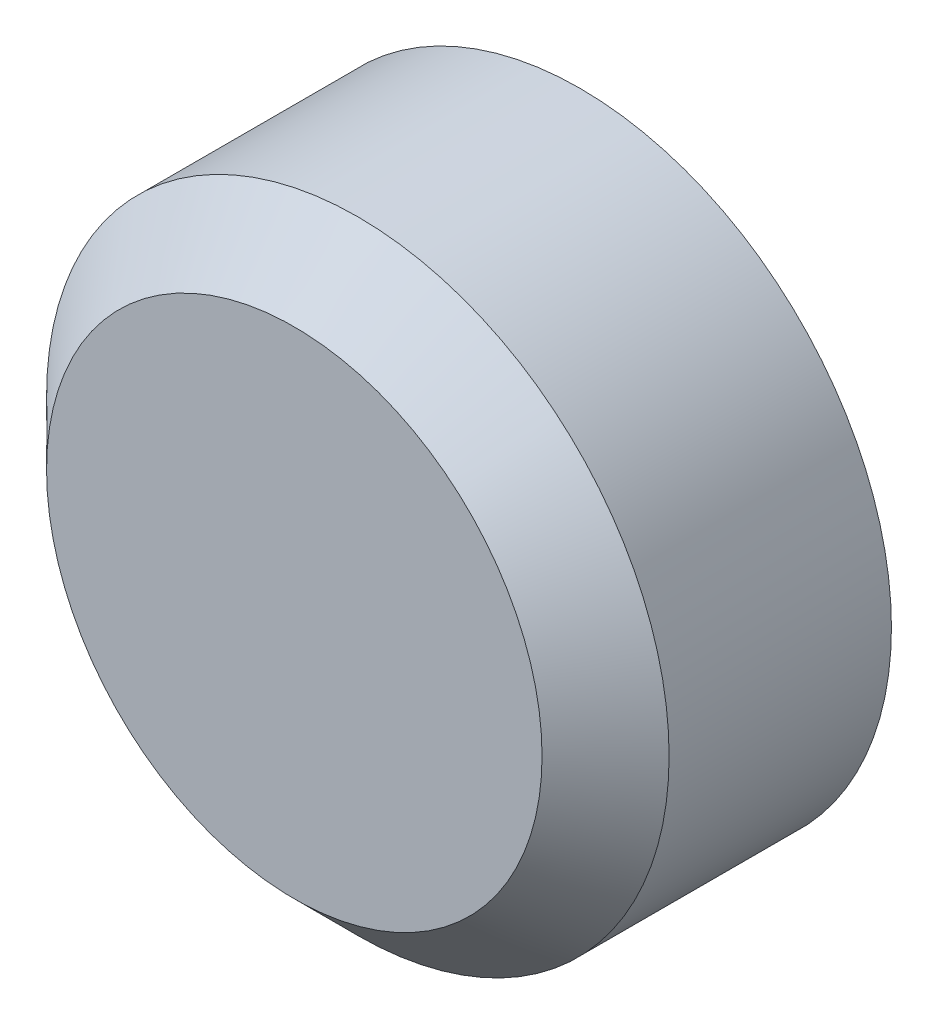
from build123d import *

# Parameters (mm, degrees)
SKETCH1_R           = 9.8
BOSS_EXTRUDE1_DEPTH = 9
CUT_EXTRUDE1_DEPTH  = 6.5
CHAMFER1_SIZE       = 2
CHAMFER2_SIZE       = 0.5
CHAMFER2_SIZE2      = 1.07225346


with BuildPart() as part:
    # Sketch1 → Boss-Extrude1 (new body)
    with BuildSketch(Plane.XY):
        Circle(SKETCH1_R)
    extrude(amount=BOSS_EXTRUDE1_DEPTH)

    # Sketch2 → Cut-Extrude1 (cut)
    with BuildSketch(Plane(origin=(0, 0, 0), x_dir=(-1, 0, 0), z_dir=(0, 0, -1))):
        with BuildLine():
            Line((-6.262387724, 4.65), (6.262387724, 4.65))
            ThreePointArc((6.262387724, 4.65), (0, -7.8), (-6.262387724, 4.65))
        make_face()
    extrude(amount=-CUT_EXTRUDE1_DEPTH, mode=Mode.SUBTRACT)

    # Chamfer1
    chamfer1_edges = [part.edges().sort_by_distance(p)[0] for p in [
        (-9.8, 0, 9),
    ]]
    chamfer(chamfer1_edges, length=CHAMFER1_SIZE)

    # Chamfer2
    chamfer2_edges = [part.edges().sort_by_distance(p)[0] for p in [
        (0, -7.8, 0),
        (0, 4.65, 0),
    ]]
    chamfer2_side = [part.faces().sort_by_distance(p)[0] for p in [
        (-9.522814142, 0, 0),
    ]]
    chamfer(chamfer2_edges, length=CHAMFER2_SIZE, length2=CHAMFER2_SIZE2, reference=chamfer2_side[0])


solid = part.part
